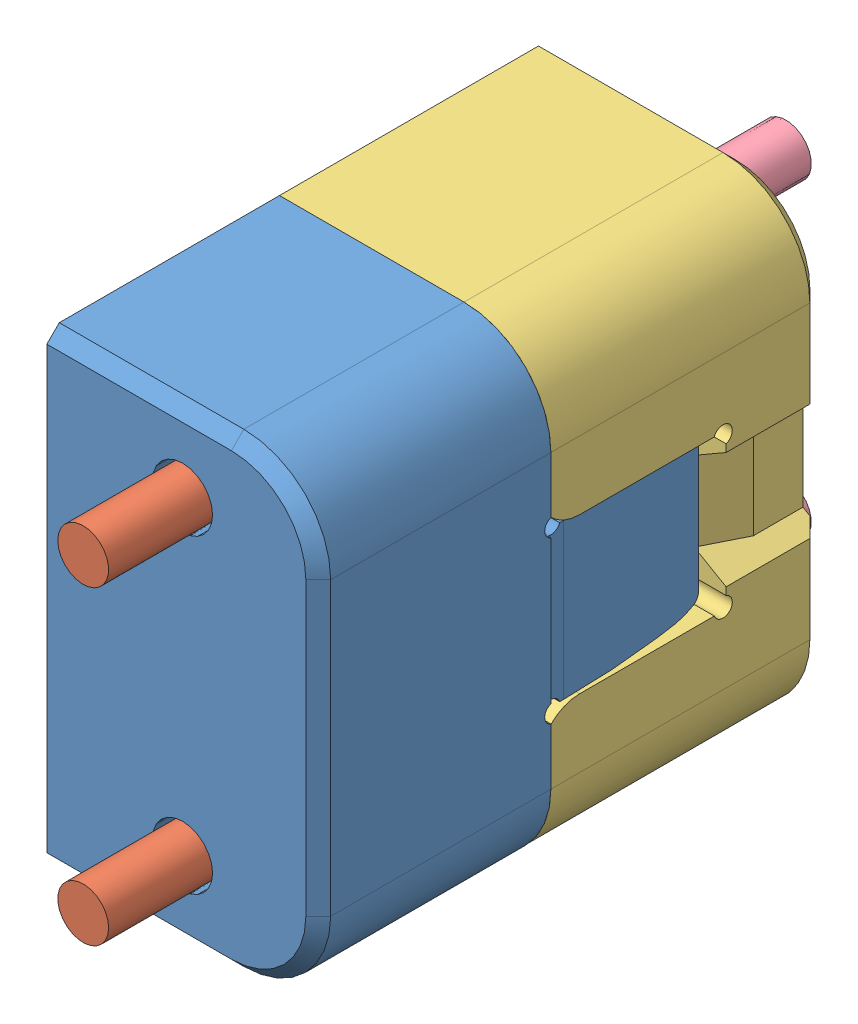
SolidWorks assembly TL87X150.sldasm, configuration Default (file format 11000). Lengths in mm.
Overall size (22.23 38.1 57.55).
8 component instances, 4 part files, 6 mates.
Components (placement in the parent):
- TL87X150 MALE HALF-1: TL87X150 MALE HALF.sldasm [Default] at origin size (22.23 38.1 40.75)
  - TL87X150 MALE-1: TL87X150 MALE.sldprt [Default] at (11.1125 0 0) size (22.23 38.1 32.61)
  - SHCS8-32L.87-1: SHCS8-32L.87.sldprt [SHCS8-32L.87] at (11.1125 -12.7 4.9606) size (6.86 6.86 26.39)
  - SHCS8-32L.87-2: SHCS8-32L.87.sldprt [SHCS8-32L.87] at (11.1125 12.7 4.9606) x (-1 0 0) z (0 0 1) size (6.86 6.86 26.39)
- TL87X150 FEMALE HALF-1: TL87X150 FEMALE HALF.sldasm [Default] at origin size (22.23 38.1 30.36)
  - TL87X150 FEMALE-1: TL87X150 FEMALE.sldprt [Default] at (11.1125 0 0) x (-1 0 0) z (0 0 1) size (22.23 38.1 22.23)
  - SHCS8-32L1.00-1: SHCS8-32L1.00.sldprt [SHCS8-32L1.00] at (11.1125 12.7 -4.9606) x (-0.923728 -0.383049 0) z (0 0 -1) size (6.86 6.86 29.57)
  - SHCS8-32L1.00-2: SHCS8-32L1.00.sldprt [SHCS8-32L1.00] at (11.1125 -12.7 -4.9606) x (0.923728 -0.383049 0) z (0 0 -1) size (6.86 6.86 29.57)
Mates (geometry in assembly coordinates):
- Coincident1: coincident: plane of TL87X150 MALE HALF-1 through (0 0 0) normal (0 0 1); plane of assembly through (0 0 0) normal (0 0 1)
- Coincident2: coincident: plane of TL87X150 MALE HALF-1 through (0 0 0) normal (0 1 0); plane of assembly through (0 0 0) normal (0 1 0)
- Coincident3: coincident: plane of TL87X150 MALE HALF-1 through (0 0 0) normal (1 0 0); plane of assembly through (0 0 0) normal (1 0 0)
- Coincident4: coincident: plane of TL87X150 FEMALE HALF-1 through (0 0 0) normal (0 0 1); plane of assembly through (0 0 0) normal (0 0 1)
- Coincident5: coincident: plane of TL87X150 FEMALE HALF-1 through (0 0 0) normal (0 1 0); plane of assembly through (0 0 0) normal (0 1 0)
- Coincident6: coincident: plane of TL87X150 FEMALE HALF-1 through (0 0 0) normal (1 0 0); plane of assembly through (0 0 0) normal (1 0 0)
